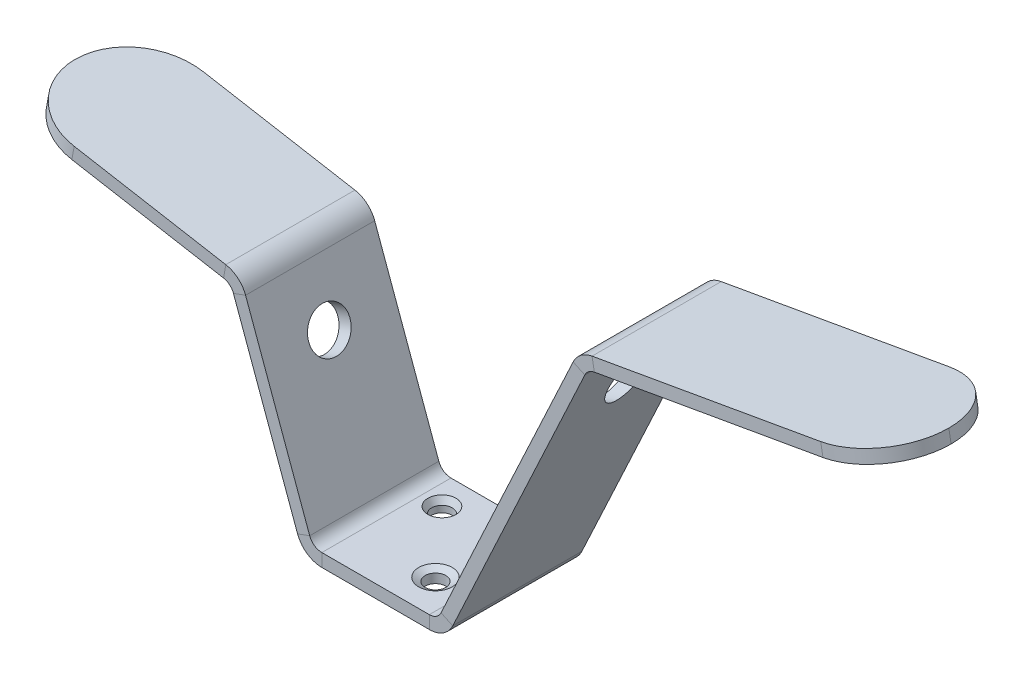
ISO-10303-21;
HEADER;
FILE_DESCRIPTION(('STEP AP214'),'2;1');
FILE_NAME('part.step','',(''),(''),'','','');
FILE_SCHEMA(('AUTOMOTIVE_DESIGN { 1 0 10303 214 1 1 1 1 }'));
ENDSEC;
DATA;
#1=APPLICATION_CONTEXT('core data for automotive mechanical design processes');
#2=APPLICATION_PROTOCOL_DEFINITION('international standard','automotive_design',2000,#1);
#3=PRODUCT_CONTEXT('',#1,'mechanical');
#4=PRODUCT('Part','Part','',(#3));
#5=PRODUCT_RELATED_PRODUCT_CATEGORY('part','',(#4));
#6=PRODUCT_DEFINITION_FORMATION('','',#4);
#7=PRODUCT_DEFINITION_CONTEXT('part definition',#1,'design');
#8=PRODUCT_DEFINITION('design','',#6,#7);
#9=PRODUCT_DEFINITION_SHAPE('','',#8);
#10=(LENGTH_UNIT() NAMED_UNIT(*) SI_UNIT(.MILLI.,.METRE.));
#11=(NAMED_UNIT(*) PLANE_ANGLE_UNIT() SI_UNIT($,.RADIAN.));
#12=(NAMED_UNIT(*) SI_UNIT($,.STERADIAN.) SOLID_ANGLE_UNIT());
#13=UNCERTAINTY_MEASURE_WITH_UNIT(LENGTH_MEASURE(1.E-05),#10,'distance_accuracy_value','');
#14=(GEOMETRIC_REPRESENTATION_CONTEXT(3) GLOBAL_UNCERTAINTY_ASSIGNED_CONTEXT((#13)) GLOBAL_UNIT_ASSIGNED_CONTEXT((#10,
#11,#12)) REPRESENTATION_CONTEXT('',''));
#15=CARTESIAN_POINT('',(0.,0.,0.));
#16=DIRECTION('',(0.,0.,1.));
#17=DIRECTION('',(1.,0.,0.));
#18=AXIS2_PLACEMENT_3D('',#15,#16,#17);
#19=CARTESIAN_POINT('',(-71.2127899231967,-40.1106257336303,-10.));
#20=DIRECTION('',(0.173648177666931,0.984807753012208,0.));
#21=DIRECTION('',(-0.984807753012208,0.173648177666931,0.));
#22=AXIS2_PLACEMENT_3D('',#19,#20,#21);
#23=CYLINDRICAL_SURFACE('',#22,10.);
#24=DIRECTION('',(0.173648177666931,0.984807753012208,0.));
#25=VECTOR('',#24,1.);
#26=CARTESIAN_POINT('',(-81.0608674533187,-38.374143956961,-10.));
#27=LINE('',#26,#25);
#28=CARTESIAN_POINT('',(-67.7549360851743,37.0875427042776,-10.));
#29=VERTEX_POINT('',#28);
#30=CARTESIAN_POINT('',(-67.4076397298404,39.057158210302,-10.));
#31=VERTEX_POINT('',#30);
#32=EDGE_CURVE('E254',#29,#31,#27,.T.);
#33=ORIENTED_EDGE('',*,*,#32,.F.);
#34=CARTESIAN_POINT('',(-57.9068585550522,35.3510609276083,-10.));
#35=DIRECTION('',(0.173648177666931,0.984807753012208,0.));
#36=DIRECTION('',(0.984807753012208,-0.173648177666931,0.));
#37=AXIS2_PLACEMENT_3D('',#34,#35,#36);
#38=CIRCLE('',#37,10.);
#39=CARTESIAN_POINT('',(-57.9068585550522,35.3510609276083,0.));
#40=VERTEX_POINT('',#39);
#41=EDGE_CURVE('E284',#29,#40,#38,.T.);
#42=ORIENTED_EDGE('',*,*,#41,.T.);
#43=DIRECTION('',(0.173648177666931,0.984807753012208,0.));
#44=VECTOR('',#43,1.);
#45=CARTESIAN_POINT('',(-71.2127899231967,-40.1106257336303,0.));
#46=LINE('',#45,#44);
#47=CARTESIAN_POINT('',(-57.5595621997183,37.3206764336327,0.));
#48=VERTEX_POINT('',#47);
#49=EDGE_CURVE('E258',#40,#48,#46,.T.);
#50=ORIENTED_EDGE('',*,*,#49,.T.);
#51=CARTESIAN_POINT('',(-57.5595621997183,37.3206764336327,-10.));
#52=DIRECTION('',(0.173648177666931,0.984807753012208,0.));
#53=DIRECTION('',(0.984807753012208,-0.173648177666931,0.));
#54=AXIS2_PLACEMENT_3D('',#51,#52,#53);
#55=CIRCLE('',#54,10.);
#56=EDGE_CURVE('E262',#48,#31,#55,.F.);
#57=ORIENTED_EDGE('',*,*,#56,.T.);
#58=EDGE_LOOP('',(#33,#42,#50,#57));
#59=FACE_BOUND('',#58,.T.);
#60=ADVANCED_FACE('F26',(#59),#23,.T.);
#61=CARTESIAN_POINT('',(-71.2127899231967,-40.1106257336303,-10.));
#62=DIRECTION('',(0.173648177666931,0.984807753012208,0.));
#63=DIRECTION('',(-0.984807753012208,0.173648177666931,0.));
#64=AXIS2_PLACEMENT_3D('',#61,#62,#63);
#65=CYLINDRICAL_SURFACE('',#64,10.);
#66=DIRECTION('',(0.173648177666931,0.984807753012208,0.));
#67=VECTOR('',#66,1.);
#68=CARTESIAN_POINT('',(-71.2127899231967,-40.1106257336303,-20.));
#69=LINE('',#68,#67);
#70=CARTESIAN_POINT('',(-57.9068585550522,35.3510609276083,-20.));
#71=VERTEX_POINT('',#70);
#72=CARTESIAN_POINT('',(-57.5595621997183,37.3206764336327,-20.));
#73=VERTEX_POINT('',#72);
#74=EDGE_CURVE('E275',#71,#73,#69,.T.);
#75=ORIENTED_EDGE('',*,*,#74,.F.);
#76=CARTESIAN_POINT('',(-57.9068585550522,35.3510609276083,-10.));
#77=DIRECTION('',(0.173648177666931,0.984807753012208,0.));
#78=DIRECTION('',(0.984807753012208,-0.173648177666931,0.));
#79=AXIS2_PLACEMENT_3D('',#76,#77,#78);
#80=CIRCLE('',#79,10.);
#81=EDGE_CURVE('E443',#71,#29,#80,.T.);
#82=ORIENTED_EDGE('',*,*,#81,.T.);
#83=ORIENTED_EDGE('',*,*,#32,.T.);
#84=CARTESIAN_POINT('',(-57.5595621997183,37.3206764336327,-10.));
#85=DIRECTION('',(0.173648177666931,0.984807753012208,0.));
#86=DIRECTION('',(0.984807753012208,-0.173648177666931,0.));
#87=AXIS2_PLACEMENT_3D('',#84,#85,#86);
#88=CIRCLE('',#87,10.);
#89=EDGE_CURVE('E69',#31,#73,#88,.F.);
#90=ORIENTED_EDGE('',*,*,#89,.T.);
#91=EDGE_LOOP('',(#75,#82,#83,#90));
#92=FACE_BOUND('',#91,.T.);
#93=ADVANCED_FACE('F449',(#92),#65,.T.);
#94=CARTESIAN_POINT('',(-46.5925960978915,-44.4518301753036,-20.));
#95=DIRECTION('',(0.,0.,1.));
#96=DIRECTION('',(-0.984807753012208,0.173648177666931,0.));
#97=AXIS2_PLACEMENT_3D('',#94,#95,#96);
#98=PLANE('',#97);
#99=DIRECTION('',(0.173648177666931,0.984807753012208,0.));
#100=VECTOR('',#99,1.);
#101=CARTESIAN_POINT('',(-47.7297541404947,-44.251318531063,-20.));
#102=LINE('',#101,#100);
#103=CARTESIAN_POINT('',(-34.4238227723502,31.2103681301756,-20.));
#104=VERTEX_POINT('',#103);
#105=CARTESIAN_POINT('',(-34.0765264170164,33.1799836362,-20.));
#106=VERTEX_POINT('',#105);
#107=EDGE_CURVE('E272',#104,#106,#102,.T.);
#108=ORIENTED_EDGE('',*,*,#107,.F.);
#109=DIRECTION('',(-0.984807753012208,0.173648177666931,0.));
#110=VECTOR('',#109,1.);
#111=CARTESIAN_POINT('',(-33.286664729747,31.009856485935,-20.));
#112=LINE('',#111,#110);
#113=EDGE_CURVE('E244',#104,#71,#112,.T.);
#114=ORIENTED_EDGE('',*,*,#113,.T.);
#115=ORIENTED_EDGE('',*,*,#74,.T.);
#116=DIRECTION('',(-0.984807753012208,0.173648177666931,0.));
#117=VECTOR('',#116,1.);
#118=CARTESIAN_POINT('',(-32.9393683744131,32.9794719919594,-20.));
#119=LINE('',#118,#117);
#120=EDGE_CURVE('E65',#106,#73,#119,.T.);
#121=ORIENTED_EDGE('',*,*,#120,.F.);
#122=EDGE_LOOP('',(#108,#114,#115,#121));
#123=FACE_BOUND('',#122,.T.);
#124=ADVANCED_FACE('F445',(#123),#98,.F.);
#125=CARTESIAN_POINT('',(-32.9393683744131,32.9794719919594,-20.));
#126=DIRECTION('',(-0.173648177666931,-0.984807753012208,0.));
#127=DIRECTION('',(0.984807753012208,-0.173648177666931,0.));
#128=AXIS2_PLACEMENT_3D('',#125,#126,#127);
#129=PLANE('',#128);
#130=ORIENTED_EDGE('',*,*,#120,.T.);
#131=ORIENTED_EDGE('',*,*,#89,.F.);
#132=ORIENTED_EDGE('',*,*,#56,.F.);
#133=DIRECTION('',(-0.984807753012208,0.173648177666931,0.));
#134=VECTOR('',#133,1.);
#135=CARTESIAN_POINT('',(-32.9393683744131,32.9794719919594,0.));
#136=LINE('',#135,#134);
#137=CARTESIAN_POINT('',(-34.0765264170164,33.1799836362,0.));
#138=VERTEX_POINT('',#137);
#139=EDGE_CURVE('E267',#138,#48,#136,.T.);
#140=ORIENTED_EDGE('',*,*,#139,.F.);
#141=DIRECTION('',(0.,0.,1.));
#142=VECTOR('',#141,1.);
#143=CARTESIAN_POINT('',(-34.0765264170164,33.1799836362,-20.));
#144=LINE('',#143,#142);
#145=EDGE_CURVE('E269',#106,#138,#144,.T.);
#146=ORIENTED_EDGE('',*,*,#145,.F.);
#147=EDGE_LOOP('',(#130,#131,#132,#140,#146));
#148=FACE_BOUND('',#147,.T.);
#149=ADVANCED_FACE('F452',(#148),#129,.F.);
#150=CARTESIAN_POINT('',(-46.5925960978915,-44.4518301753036,0.));
#151=DIRECTION('',(0.,0.,1.));
#152=DIRECTION('',(-0.984807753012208,0.173648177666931,0.));
#153=AXIS2_PLACEMENT_3D('',#150,#151,#152);
#154=PLANE('',#153);
#155=ORIENTED_EDGE('',*,*,#139,.T.);
#156=ORIENTED_EDGE('',*,*,#49,.F.);
#157=DIRECTION('',(-0.984807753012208,0.173648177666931,0.));
#158=VECTOR('',#157,1.);
#159=CARTESIAN_POINT('',(-33.286664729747,31.009856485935,0.));
#160=LINE('',#159,#158);
#161=CARTESIAN_POINT('',(-34.4238227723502,31.2103681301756,0.));
#162=VERTEX_POINT('',#161);
#163=EDGE_CURVE('E43',#162,#40,#160,.T.);
#164=ORIENTED_EDGE('',*,*,#163,.F.);
#165=DIRECTION('',(0.173648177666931,0.984807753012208,0.));
#166=VECTOR('',#165,1.);
#167=CARTESIAN_POINT('',(-47.7297541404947,-44.251318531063,0.));
#168=LINE('',#167,#166);
#169=EDGE_CURVE('E246',#162,#138,#168,.T.);
#170=ORIENTED_EDGE('',*,*,#169,.T.);
#171=EDGE_LOOP('',(#155,#156,#164,#170));
#172=FACE_BOUND('',#171,.T.);
#173=ADVANCED_FACE('F256',(#172),#154,.T.);
#174=CARTESIAN_POINT('',(-33.286664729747,31.009856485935,-20.));
#175=DIRECTION('',(-0.173648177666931,-0.984807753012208,0.));
#176=DIRECTION('',(0.984807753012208,-0.173648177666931,0.));
#177=AXIS2_PLACEMENT_3D('',#174,#175,#176);
#178=PLANE('',#177);
#179=DIRECTION('',(0.,0.,1.));
#180=VECTOR('',#179,1.);
#181=CARTESIAN_POINT('',(-34.4238227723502,31.2103681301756,-20.));
#182=LINE('',#181,#180);
#183=EDGE_CURVE('E234',#104,#162,#182,.T.);
#184=ORIENTED_EDGE('',*,*,#183,.T.);
#185=ORIENTED_EDGE('',*,*,#163,.T.);
#186=ORIENTED_EDGE('',*,*,#41,.F.);
#187=ORIENTED_EDGE('',*,*,#81,.F.);
#188=ORIENTED_EDGE('',*,*,#113,.F.);
#189=EDGE_LOOP('',(#184,#185,#186,#187,#188));
#190=FACE_BOUND('',#189,.T.);
#191=ADVANCED_FACE('F28',(#190),#178,.T.);
#192=CARTESIAN_POINT('',(-84.4215460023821,1.92113291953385,-10.));
#193=DIRECTION('',(0.93969262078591,0.342020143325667,0.));
#194=DIRECTION('',(-0.342020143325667,0.93969262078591,0.));
#195=AXIS2_PLACEMENT_3D('',#192,#193,#194);
#196=CYLINDRICAL_SURFACE('',#195,3.2);
#197=CARTESIAN_POINT('',(-29.9193739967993,21.7583012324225,-10.));
#198=DIRECTION('',(0.93969262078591,0.342020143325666,0.));
#199=DIRECTION('',(0.342020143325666,-0.93969262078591,0.));
#200=AXIS2_PLACEMENT_3D('',#197,#198,#199);
#201=CIRCLE('',#200,3.2);
#202=CARTESIAN_POINT('',(-28.8249095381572,18.7512848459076,-10.));
#203=VERTEX_POINT('',#202);
#204=EDGE_CURVE('E434',#203,#203,#201,.T.);
#205=ORIENTED_EDGE('',*,*,#204,.F.);
#206=EDGE_LOOP('',(#205));
#207=FACE_BOUND('',#206,.T.);
#208=CARTESIAN_POINT('',(-28.0399887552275,22.4423415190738,-10.));
#209=DIRECTION('',(0.93969262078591,0.342020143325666,0.));
#210=DIRECTION('',(0.342020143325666,-0.93969262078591,0.));
#211=AXIS2_PLACEMENT_3D('',#208,#209,#210);
#212=CIRCLE('',#211,3.2);
#213=CARTESIAN_POINT('',(-26.9455242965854,19.4353251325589,-10.));
#214=VERTEX_POINT('',#213);
#215=EDGE_CURVE('E412',#214,#214,#212,.T.);
#216=ORIENTED_EDGE('',*,*,#215,.T.);
#217=EDGE_LOOP('',(#216));
#218=FACE_BOUND('',#217,.T.);
#219=ADVANCED_FACE('F537',(#207,#218),#196,.F.);
#220=CARTESIAN_POINT('',(46.1548658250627,24.8063424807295,0.));
#221=DIRECTION('',(0.,0.,-1.));
#222=DIRECTION('',(0.342020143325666,-0.93969262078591,0.));
#223=AXIS2_PLACEMENT_3D('',#220,#221,#222);
#224=PLANE('',#223);
#225=DIRECTION('',(0.342020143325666,-0.93969262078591,0.));
#226=VECTOR('',#225,1.);
#227=CARTESIAN_POINT('',(-22.,0.,0.));
#228=LINE('',#227,#226);
#229=CARTESIAN_POINT('',(-32.8917338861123,29.9247929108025,0.));
#230=VERTEX_POINT('',#229);
#231=CARTESIAN_POINT('',(-22.9579403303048,2.63191942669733,0.));
#232=VERTEX_POINT('',#231);
#233=EDGE_CURVE('E423',#230,#232,#228,.T.);
#234=ORIENTED_EDGE('',*,*,#233,.T.);
#235=DIRECTION('',(-0.93969262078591,-0.342020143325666,0.));
#236=VECTOR('',#235,1.);
#237=CARTESIAN_POINT('',(45.1969254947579,27.4382619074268,0.));
#238=LINE('',#237,#236);
#239=CARTESIAN_POINT('',(-21.078555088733,3.31595971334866,0.));
#240=VERTEX_POINT('',#239);
#241=EDGE_CURVE('E426',#240,#232,#238,.T.);
#242=ORIENTED_EDGE('',*,*,#241,.F.);
#243=DIRECTION('',(0.342020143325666,-0.93969262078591,0.));
#244=VECTOR('',#243,1.);
#245=CARTESIAN_POINT('',(-20.1206147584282,0.684040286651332,0.));
#246=LINE('',#245,#244);
#247=CARTESIAN_POINT('',(-31.0123486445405,30.6088331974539,0.));
#248=VERTEX_POINT('',#247);
#249=EDGE_CURVE('E428',#248,#240,#246,.T.);
#250=ORIENTED_EDGE('',*,*,#249,.F.);
#251=DIRECTION('',(-0.93969262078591,-0.342020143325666,0.));
#252=VECTOR('',#251,1.);
#253=CARTESIAN_POINT('',(35.2631319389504,54.731135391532,0.));
#254=LINE('',#253,#252);
#255=EDGE_CURVE('E431',#248,#230,#254,.T.);
#256=ORIENTED_EDGE('',*,*,#255,.T.);
#257=EDGE_LOOP('',(#234,#242,#250,#256));
#258=FACE_BOUND('',#257,.T.);
#259=ADVANCED_FACE('F505',(#258),#224,.F.);
#260=CARTESIAN_POINT('',(-22.,0.,-20.));
#261=DIRECTION('',(-0.93969262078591,-0.342020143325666,0.));
#262=DIRECTION('',(0.342020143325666,-0.93969262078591,0.));
#263=AXIS2_PLACEMENT_3D('',#260,#261,#262);
#264=PLANE('',#263);
#265=DIRECTION('',(0.,0.,-1.));
#266=VECTOR('',#265,1.);
#267=CARTESIAN_POINT('',(-32.8917338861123,29.9247929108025,-20.));
#268=LINE('',#267,#266);
#269=CARTESIAN_POINT('',(-32.8917338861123,29.9247929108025,-20.));
#270=VERTEX_POINT('',#269);
#271=EDGE_CURVE('E237',#230,#270,#268,.T.);
#272=ORIENTED_EDGE('',*,*,#271,.T.);
#273=DIRECTION('',(-0.342020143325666,0.93969262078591,0.));
#274=VECTOR('',#273,1.);
#275=CARTESIAN_POINT('',(-22.,0.,-20.));
#276=LINE('',#275,#274);
#277=CARTESIAN_POINT('',(-22.9579403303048,2.63191942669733,-20.));
#278=VERTEX_POINT('',#277);
#279=EDGE_CURVE('E420',#278,#270,#276,.T.);
#280=ORIENTED_EDGE('',*,*,#279,.F.);
#281=DIRECTION('',(0.,0.,1.));
#282=VECTOR('',#281,1.);
#283=CARTESIAN_POINT('',(-22.9579403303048,2.63191942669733,0.));
#284=LINE('',#283,#282);
#285=EDGE_CURVE('E437',#278,#232,#284,.T.);
#286=ORIENTED_EDGE('',*,*,#285,.T.);
#287=ORIENTED_EDGE('',*,*,#233,.F.);
#288=EDGE_LOOP('',(#272,#280,#286,#287));
#289=FACE_BOUND('',#288,.T.);
#290=ORIENTED_EDGE('',*,*,#204,.T.);
#291=EDGE_LOOP('',(#290));
#292=FACE_BOUND('',#291,.T.);
#293=ADVANCED_FACE('F499',(#289,#292),#264,.T.);
#294=CARTESIAN_POINT('',(46.1548658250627,24.8063424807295,-20.));
#295=DIRECTION('',(0.,0.,-1.));
#296=DIRECTION('',(0.342020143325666,-0.93969262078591,0.));
#297=AXIS2_PLACEMENT_3D('',#294,#295,#296);
#298=PLANE('',#297);
#299=DIRECTION('',(-0.93969262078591,-0.342020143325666,0.));
#300=VECTOR('',#299,1.);
#301=CARTESIAN_POINT('',(35.2631319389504,54.731135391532,-20.));
#302=LINE('',#301,#300);
#303=CARTESIAN_POINT('',(-31.0123486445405,30.6088331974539,-20.));
#304=VERTEX_POINT('',#303);
#305=EDGE_CURVE('E418',#304,#270,#302,.T.);
#306=ORIENTED_EDGE('',*,*,#305,.F.);
#307=DIRECTION('',(-0.342020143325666,0.93969262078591,0.));
#308=VECTOR('',#307,1.);
#309=CARTESIAN_POINT('',(-20.1206147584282,0.684040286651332,-20.));
#310=LINE('',#309,#308);
#311=CARTESIAN_POINT('',(-21.078555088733,3.31595971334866,-20.));
#312=VERTEX_POINT('',#311);
#313=EDGE_CURVE('E415',#312,#304,#310,.T.);
#314=ORIENTED_EDGE('',*,*,#313,.F.);
#315=DIRECTION('',(-0.93969262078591,-0.342020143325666,0.));
#316=VECTOR('',#315,1.);
#317=CARTESIAN_POINT('',(45.1969254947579,27.4382619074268,-20.));
#318=LINE('',#317,#316);
#319=EDGE_CURVE('E373',#312,#278,#318,.T.);
#320=ORIENTED_EDGE('',*,*,#319,.T.);
#321=ORIENTED_EDGE('',*,*,#279,.T.);
#322=EDGE_LOOP('',(#306,#314,#320,#321));
#323=FACE_BOUND('',#322,.T.);
#324=ADVANCED_FACE('F554',(#323),#298,.T.);
#325=CARTESIAN_POINT('',(-20.1206147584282,0.684040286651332,-20.));
#326=DIRECTION('',(-0.93969262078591,-0.342020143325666,0.));
#327=DIRECTION('',(0.342020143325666,-0.93969262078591,0.));
#328=AXIS2_PLACEMENT_3D('',#325,#326,#327);
#329=PLANE('',#328);
#330=ORIENTED_EDGE('',*,*,#215,.F.);
#331=EDGE_LOOP('',(#330));
#332=FACE_BOUND('',#331,.T.);
#333=ORIENTED_EDGE('',*,*,#249,.T.);
#334=DIRECTION('',(0.,0.,1.));
#335=VECTOR('',#334,1.);
#336=CARTESIAN_POINT('',(-21.078555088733,3.31595971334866,0.));
#337=LINE('',#336,#335);
#338=EDGE_CURVE('E247',#312,#240,#337,.T.);
#339=ORIENTED_EDGE('',*,*,#338,.F.);
#340=ORIENTED_EDGE('',*,*,#313,.T.);
#341=DIRECTION('',(0.,0.,-1.));
#342=VECTOR('',#341,1.);
#343=CARTESIAN_POINT('',(-31.0123486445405,30.6088331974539,-20.));
#344=LINE('',#343,#342);
#345=EDGE_CURVE('E409',#248,#304,#344,.T.);
#346=ORIENTED_EDGE('',*,*,#345,.F.);
#347=EDGE_LOOP('',(#333,#339,#340,#346));
#348=FACE_BOUND('',#347,.T.);
#349=ADVANCED_FACE('F508',(#332,#348),#329,.F.);
#350=CARTESIAN_POINT('',(75.4739365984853,-43.1985139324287,-10.));
#351=DIRECTION('',(-0.173648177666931,0.984807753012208,0.));
#352=DIRECTION('',(-0.984807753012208,-0.173648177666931,0.));
#353=AXIS2_PLACEMENT_3D('',#350,#351,#352);
#354=CYLINDRICAL_SURFACE('',#353,10.);
#355=DIRECTION('',(-0.173648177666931,0.984807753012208,0.));
#356=VECTOR('',#355,1.);
#357=CARTESIAN_POINT('',(85.3220141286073,-41.4620321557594,-10.));
#358=LINE('',#357,#356);
#359=CARTESIAN_POINT('',(68.2621140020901,55.2894692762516,-10.));
#360=VERTEX_POINT('',#359);
#361=CARTESIAN_POINT('',(67.9148176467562,57.259084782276,-10.));
#362=VERTEX_POINT('',#361);
#363=EDGE_CURVE('E402',#360,#362,#358,.T.);
#364=ORIENTED_EDGE('',*,*,#363,.F.);
#365=CARTESIAN_POINT('',(58.414036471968,53.5529874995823,-10.));
#366=DIRECTION('',(-0.173648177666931,0.984807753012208,0.));
#367=DIRECTION('',(0.984807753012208,0.173648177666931,0.));
#368=AXIS2_PLACEMENT_3D('',#365,#366,#367);
#369=CIRCLE('',#368,10.);
#370=CARTESIAN_POINT('',(58.414036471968,53.5529874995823,-20.));
#371=VERTEX_POINT('',#370);
#372=EDGE_CURVE('E374',#360,#371,#369,.T.);
#373=ORIENTED_EDGE('',*,*,#372,.T.);
#374=DIRECTION('',(-0.173648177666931,0.984807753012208,0.));
#375=VECTOR('',#374,1.);
#376=CARTESIAN_POINT('',(75.4739365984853,-43.1985139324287,-20.));
#377=LINE('',#376,#375);
#378=CARTESIAN_POINT('',(58.0667401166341,55.5226030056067,-20.));
#379=VERTEX_POINT('',#378);
#380=EDGE_CURVE('E381',#371,#379,#377,.T.);
#381=ORIENTED_EDGE('',*,*,#380,.T.);
#382=CARTESIAN_POINT('',(58.0667401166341,55.5226030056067,-10.));
#383=DIRECTION('',(-0.173648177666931,0.984807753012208,0.));
#384=DIRECTION('',(0.984807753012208,0.173648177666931,0.));
#385=AXIS2_PLACEMENT_3D('',#382,#383,#384);
#386=CIRCLE('',#385,10.);
#387=EDGE_CURVE('E387',#379,#362,#386,.F.);
#388=ORIENTED_EDGE('',*,*,#387,.T.);
#389=EDGE_LOOP('',(#364,#373,#381,#388));
#390=FACE_BOUND('',#389,.T.);
#391=ADVANCED_FACE('F560',(#390),#354,.T.);
#392=CARTESIAN_POINT('',(75.4739365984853,-43.1985139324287,-10.));
#393=DIRECTION('',(-0.173648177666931,0.984807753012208,0.));
#394=DIRECTION('',(-0.984807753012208,-0.173648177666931,0.));
#395=AXIS2_PLACEMENT_3D('',#392,#393,#394);
#396=CYLINDRICAL_SURFACE('',#395,10.);
#397=DIRECTION('',(-0.173648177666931,0.984807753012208,0.));
#398=VECTOR('',#397,1.);
#399=CARTESIAN_POINT('',(75.4739365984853,-43.1985139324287,0.));
#400=LINE('',#399,#398);
#401=CARTESIAN_POINT('',(58.414036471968,53.5529874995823,0.));
#402=VERTEX_POINT('',#401);
#403=CARTESIAN_POINT('',(58.0667401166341,55.5226030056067,0.));
#404=VERTEX_POINT('',#403);
#405=EDGE_CURVE('E400',#402,#404,#400,.T.);
#406=ORIENTED_EDGE('',*,*,#405,.F.);
#407=CARTESIAN_POINT('',(58.414036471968,53.5529874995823,-10.));
#408=DIRECTION('',(-0.173648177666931,0.984807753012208,0.));
#409=DIRECTION('',(0.984807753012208,0.173648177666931,0.));
#410=AXIS2_PLACEMENT_3D('',#407,#408,#409);
#411=CIRCLE('',#410,10.);
#412=EDGE_CURVE('E136',#402,#360,#411,.T.);
#413=ORIENTED_EDGE('',*,*,#412,.T.);
#414=ORIENTED_EDGE('',*,*,#363,.T.);
#415=CARTESIAN_POINT('',(58.0667401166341,55.5226030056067,-10.));
#416=DIRECTION('',(-0.173648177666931,0.984807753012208,0.));
#417=DIRECTION('',(0.984807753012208,0.173648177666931,0.));
#418=AXIS2_PLACEMENT_3D('',#415,#416,#417);
#419=CIRCLE('',#418,10.);
#420=EDGE_CURVE('E384',#362,#404,#419,.F.);
#421=ORIENTED_EDGE('',*,*,#420,.T.);
#422=EDGE_LOOP('',(#406,#413,#414,#421));
#423=FACE_BOUND('',#422,.T.);
#424=ADVANCED_FACE('F621',(#423),#396,.T.);
#425=CARTESIAN_POINT('',(85.3220141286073,-41.4620321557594,0.));
#426=DIRECTION('',(0.,0.,1.));
#427=DIRECTION('',(-0.984807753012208,-0.173648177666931,0.));
#428=AXIS2_PLACEMENT_3D('',#425,#426,#427);
#429=PLANE('',#428);
#430=DIRECTION('',(-0.984807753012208,-0.173648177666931,0.));
#431=VECTOR('',#430,1.);
#432=CARTESIAN_POINT('',(67.9148176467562,57.259084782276,0.));
#433=LINE('',#432,#431);
#434=CARTESIAN_POINT('',(22.6541701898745,49.2784114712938,0.));
#435=VERTEX_POINT('',#434);
#436=EDGE_CURVE('E393',#404,#435,#433,.T.);
#437=ORIENTED_EDGE('',*,*,#436,.T.);
#438=DIRECTION('',(-0.173648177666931,0.984807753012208,0.));
#439=VECTOR('',#438,1.);
#440=CARTESIAN_POINT('',(40.0613666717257,-49.4427054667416,0.));
#441=LINE('',#440,#439);
#442=CARTESIAN_POINT('',(23.0014665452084,47.3087959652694,0.));
#443=VERTEX_POINT('',#442);
#444=EDGE_CURVE('E396',#443,#435,#441,.T.);
#445=ORIENTED_EDGE('',*,*,#444,.F.);
#446=DIRECTION('',(-0.984807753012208,-0.173648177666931,0.));
#447=VECTOR('',#446,1.);
#448=CARTESIAN_POINT('',(68.26211400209,55.2894692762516,0.));
#449=LINE('',#448,#447);
#450=EDGE_CURVE('E129',#402,#443,#449,.T.);
#451=ORIENTED_EDGE('',*,*,#450,.F.);
#452=ORIENTED_EDGE('',*,*,#405,.T.);
#453=EDGE_LOOP('',(#437,#445,#451,#452));
#454=FACE_BOUND('',#453,.T.);
#455=ADVANCED_FACE('F625',(#454),#429,.T.);
#456=CARTESIAN_POINT('',(67.9148176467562,57.259084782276,-20.));
#457=DIRECTION('',(0.173648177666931,-0.984807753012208,0.));
#458=DIRECTION('',(0.984807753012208,0.173648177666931,0.));
#459=AXIS2_PLACEMENT_3D('',#456,#457,#458);
#460=PLANE('',#459);
#461=ORIENTED_EDGE('',*,*,#436,.F.);
#462=ORIENTED_EDGE('',*,*,#420,.F.);
#463=ORIENTED_EDGE('',*,*,#387,.F.);
#464=DIRECTION('',(-0.984807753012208,-0.173648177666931,0.));
#465=VECTOR('',#464,1.);
#466=CARTESIAN_POINT('',(67.9148176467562,57.259084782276,-20.));
#467=LINE('',#466,#465);
#468=CARTESIAN_POINT('',(22.6541701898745,49.2784114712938,-20.));
#469=VERTEX_POINT('',#468);
#470=EDGE_CURVE('E378',#379,#469,#467,.T.);
#471=ORIENTED_EDGE('',*,*,#470,.T.);
#472=DIRECTION('',(0.,0.,-1.));
#473=VECTOR('',#472,1.);
#474=CARTESIAN_POINT('',(22.6541701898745,49.2784114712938,0.));
#475=LINE('',#474,#473);
#476=EDGE_CURVE('E390',#435,#469,#475,.T.);
#477=ORIENTED_EDGE('',*,*,#476,.F.);
#478=EDGE_LOOP('',(#461,#462,#463,#471,#477));
#479=FACE_BOUND('',#478,.T.);
#480=ADVANCED_FACE('F628',(#479),#460,.F.);
#481=CARTESIAN_POINT('',(85.3220141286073,-41.4620321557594,-20.));
#482=DIRECTION('',(0.,0.,1.));
#483=DIRECTION('',(-0.984807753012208,-0.173648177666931,0.));
#484=AXIS2_PLACEMENT_3D('',#481,#482,#483);
#485=PLANE('',#484);
#486=ORIENTED_EDGE('',*,*,#380,.F.);
#487=DIRECTION('',(-0.984807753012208,-0.173648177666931,0.));
#488=VECTOR('',#487,1.);
#489=CARTESIAN_POINT('',(68.26211400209,55.2894692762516,-20.));
#490=LINE('',#489,#488);
#491=CARTESIAN_POINT('',(23.0014665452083,47.3087959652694,-20.));
#492=VERTEX_POINT('',#491);
#493=EDGE_CURVE('E107',#371,#492,#490,.T.);
#494=ORIENTED_EDGE('',*,*,#493,.T.);
#495=DIRECTION('',(-0.173648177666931,0.984807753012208,0.));
#496=VECTOR('',#495,1.);
#497=CARTESIAN_POINT('',(40.0613666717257,-49.4427054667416,-20.));
#498=LINE('',#497,#496);
#499=EDGE_CURVE('E404',#492,#469,#498,.T.);
#500=ORIENTED_EDGE('',*,*,#499,.T.);
#501=ORIENTED_EDGE('',*,*,#470,.F.);
#502=EDGE_LOOP('',(#486,#494,#500,#501));
#503=FACE_BOUND('',#502,.T.);
#504=ADVANCED_FACE('F630',(#503),#485,.F.);
#505=CARTESIAN_POINT('',(68.26211400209,55.2894692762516,-20.));
#506=DIRECTION('',(0.173648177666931,-0.984807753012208,0.));
#507=DIRECTION('',(0.984807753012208,0.173648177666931,0.));
#508=AXIS2_PLACEMENT_3D('',#505,#506,#507);
#509=PLANE('',#508);
#510=DIRECTION('',(0.,0.,-1.));
#511=VECTOR('',#510,1.);
#512=CARTESIAN_POINT('',(23.0014665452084,47.3087959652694,0.));
#513=LINE('',#512,#511);
#514=EDGE_CURVE('E335',#443,#492,#513,.T.);
#515=ORIENTED_EDGE('',*,*,#514,.T.);
#516=ORIENTED_EDGE('',*,*,#493,.F.);
#517=ORIENTED_EDGE('',*,*,#372,.F.);
#518=ORIENTED_EDGE('',*,*,#412,.F.);
#519=ORIENTED_EDGE('',*,*,#450,.T.);
#520=EDGE_LOOP('',(#515,#516,#517,#518,#519));
#521=FACE_BOUND('',#520,.T.);
#522=ADVANCED_FACE('F550',(#521),#509,.T.);
#523=CARTESIAN_POINT('',(-84.4215460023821,1.92113291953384,-10.));
#524=DIRECTION('',(0.939692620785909,0.342020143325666,0.));
#525=DIRECTION('',(-0.342020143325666,0.93969262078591,0.));
#526=AXIS2_PLACEMENT_3D('',#523,#524,#525);
#527=CYLINDRICAL_SURFACE('',#526,3.2);
#528=CARTESIAN_POINT('',(18.3360798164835,39.3218500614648,-10.));
#529=DIRECTION('',(-0.906307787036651,0.422618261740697,0.));
#530=DIRECTION('',(0.422618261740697,0.906307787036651,0.));
#531=AXIS2_PLACEMENT_3D('',#528,#529,#530);
#532=ELLIPSE('',#531,4.52548339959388,3.2);
#533=CARTESIAN_POINT('',(20.2486317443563,43.4233309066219,-10.));
#534=VERTEX_POINT('',#533);
#535=EDGE_CURVE('E364',#534,#534,#532,.T.);
#536=ORIENTED_EDGE('',*,*,#535,.F.);
#537=EDGE_LOOP('',(#536));
#538=FACE_BOUND('',#537,.T.);
#539=CARTESIAN_POINT('',(15.6782277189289,38.354471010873,-10.));
#540=DIRECTION('',(-0.906307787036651,0.422618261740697,0.));
#541=DIRECTION('',(0.422618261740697,0.906307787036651,0.));
#542=AXIS2_PLACEMENT_3D('',#539,#540,#541);
#543=ELLIPSE('',#542,4.52548339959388,3.2);
#544=CARTESIAN_POINT('',(17.5907796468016,42.45595185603,-10.));
#545=VERTEX_POINT('',#544);
#546=EDGE_CURVE('E345',#545,#545,#543,.T.);
#547=ORIENTED_EDGE('',*,*,#546,.T.);
#548=EDGE_LOOP('',(#547));
#549=FACE_BOUND('',#548,.T.);
#550=ADVANCED_FACE('F604',(#538,#549),#527,.F.);
#551=CARTESIAN_POINT('',(-74.7798911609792,92.2460877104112,-20.));
#552=DIRECTION('',(0.,0.,-1.));
#553=DIRECTION('',(0.422618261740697,0.906307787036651,0.));
#554=AXIS2_PLACEMENT_3D('',#551,#552,#553);
#555=PLANE('',#554);
#556=DIRECTION('',(0.906307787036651,-0.422618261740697,0.));
#557=VECTOR('',#556,1.);
#558=CARTESIAN_POINT('',(-95.6790906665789,47.4276097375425,-20.));
#559=LINE('',#558,#557);
#560=CARTESIAN_POINT('',(-0.735665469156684,3.1547634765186,-20.));
#561=VERTEX_POINT('',#560);
#562=CARTESIAN_POINT('',(1.07695010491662,2.30952695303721,-20.));
#563=VERTEX_POINT('',#562);
#564=EDGE_CURVE('E356',#561,#563,#559,.T.);
#565=ORIENTED_EDGE('',*,*,#564,.F.);
#566=DIRECTION('',(0.422618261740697,0.906307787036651,0.));
#567=VECTOR('',#566,1.);
#568=CARTESIAN_POINT('',(20.163534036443,47.9732414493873,-20.));
#569=LINE('',#568,#567);
#570=CARTESIAN_POINT('',(19.7235317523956,47.0296535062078,-20.));
#571=VERTEX_POINT('',#570);
#572=EDGE_CURVE('E342',#561,#571,#569,.T.);
#573=ORIENTED_EDGE('',*,*,#572,.T.);
#574=DIRECTION('',(0.906307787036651,-0.422618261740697,0.));
#575=VECTOR('',#574,1.);
#576=CARTESIAN_POINT('',(-75.2198934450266,91.3024997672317,-20.));
#577=LINE('',#576,#575);
#578=CARTESIAN_POINT('',(21.5361473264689,46.1844169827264,-20.));
#579=VERTEX_POINT('',#578);
#580=EDGE_CURVE('E358',#571,#579,#577,.T.);
#581=ORIENTED_EDGE('',*,*,#580,.T.);
#582=DIRECTION('',(0.422618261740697,0.906307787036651,0.));
#583=VECTOR('',#582,1.);
#584=CARTESIAN_POINT('',(21.9761496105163,47.1280049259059,-20.));
#585=LINE('',#584,#583);
#586=EDGE_CURVE('E353',#563,#579,#585,.T.);
#587=ORIENTED_EDGE('',*,*,#586,.F.);
#588=EDGE_LOOP('',(#565,#573,#581,#587));
#589=FACE_BOUND('',#588,.T.);
#590=ADVANCED_FACE('F575',(#589),#555,.T.);
#591=CARTESIAN_POINT('',(21.9761496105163,47.1280049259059,-20.));
#592=DIRECTION('',(0.906307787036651,-0.422618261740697,0.));
#593=DIRECTION('',(0.422618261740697,0.906307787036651,0.));
#594=AXIS2_PLACEMENT_3D('',#591,#592,#593);
#595=PLANE('',#594);
#596=DIRECTION('',(0.,0.,1.));
#597=VECTOR('',#596,1.);
#598=CARTESIAN_POINT('',(21.5361473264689,46.1844169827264,0.));
#599=LINE('',#598,#597);
#600=CARTESIAN_POINT('',(21.5361473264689,46.1844169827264,0.));
#601=VERTEX_POINT('',#600);
#602=EDGE_CURVE('E361',#579,#601,#599,.T.);
#603=ORIENTED_EDGE('',*,*,#602,.T.);
#604=DIRECTION('',(-0.422618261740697,-0.906307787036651,0.));
#605=VECTOR('',#604,1.);
#606=CARTESIAN_POINT('',(21.9761496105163,47.1280049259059,0.));
#607=LINE('',#606,#605);
#608=CARTESIAN_POINT('',(1.07695010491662,2.30952695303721,0.));
#609=VERTEX_POINT('',#608);
#610=EDGE_CURVE('E350',#601,#609,#607,.T.);
#611=ORIENTED_EDGE('',*,*,#610,.T.);
#612=DIRECTION('',(0.,0.,-1.));
#613=VECTOR('',#612,1.);
#614=CARTESIAN_POINT('',(1.07695010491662,2.30952695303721,-20.));
#615=LINE('',#614,#613);
#616=EDGE_CURVE('E367',#609,#563,#615,.T.);
#617=ORIENTED_EDGE('',*,*,#616,.T.);
#618=ORIENTED_EDGE('',*,*,#586,.T.);
#619=EDGE_LOOP('',(#603,#611,#617,#618));
#620=FACE_BOUND('',#619,.T.);
#621=ORIENTED_EDGE('',*,*,#535,.T.);
#622=EDGE_LOOP('',(#621));
#623=FACE_BOUND('',#622,.T.);
#624=ADVANCED_FACE('F570',(#620,#623),#595,.T.);
#625=CARTESIAN_POINT('',(-74.7798911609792,92.2460877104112,0.));
#626=DIRECTION('',(0.,0.,-1.));
#627=DIRECTION('',(0.422618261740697,0.906307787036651,0.));
#628=AXIS2_PLACEMENT_3D('',#625,#626,#627);
#629=PLANE('',#628);
#630=ORIENTED_EDGE('',*,*,#610,.F.);
#631=DIRECTION('',(0.906307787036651,-0.422618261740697,0.));
#632=VECTOR('',#631,1.);
#633=CARTESIAN_POINT('',(-75.2198934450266,91.3024997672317,0.));
#634=LINE('',#633,#632);
#635=CARTESIAN_POINT('',(19.7235317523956,47.0296535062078,0.));
#636=VERTEX_POINT('',#635);
#637=EDGE_CURVE('E348',#636,#601,#634,.T.);
#638=ORIENTED_EDGE('',*,*,#637,.F.);
#639=DIRECTION('',(-0.422618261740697,-0.906307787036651,0.));
#640=VECTOR('',#639,1.);
#641=CARTESIAN_POINT('',(20.163534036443,47.9732414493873,0.));
#642=LINE('',#641,#640);
#643=CARTESIAN_POINT('',(-0.735665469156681,3.1547634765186,0.));
#644=VERTEX_POINT('',#643);
#645=EDGE_CURVE('E336',#636,#644,#642,.T.);
#646=ORIENTED_EDGE('',*,*,#645,.T.);
#647=DIRECTION('',(0.906307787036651,-0.422618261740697,0.));
#648=VECTOR('',#647,1.);
#649=CARTESIAN_POINT('',(-95.6790906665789,47.4276097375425,0.));
#650=LINE('',#649,#648);
#651=EDGE_CURVE('E332',#644,#609,#650,.T.);
#652=ORIENTED_EDGE('',*,*,#651,.T.);
#653=EDGE_LOOP('',(#630,#638,#646,#652));
#654=FACE_BOUND('',#653,.T.);
#655=ADVANCED_FACE('F612',(#654),#629,.F.);
#656=CARTESIAN_POINT('',(20.163534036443,47.9732414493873,-20.));
#657=DIRECTION('',(0.906307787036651,-0.422618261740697,0.));
#658=DIRECTION('',(0.422618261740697,0.906307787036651,0.));
#659=AXIS2_PLACEMENT_3D('',#656,#657,#658);
#660=PLANE('',#659);
#661=ORIENTED_EDGE('',*,*,#546,.F.);
#662=EDGE_LOOP('',(#661));
#663=FACE_BOUND('',#662,.T.);
#664=ORIENTED_EDGE('',*,*,#572,.F.);
#665=DIRECTION('',(0.,0.,-1.));
#666=VECTOR('',#665,1.);
#667=CARTESIAN_POINT('',(-0.735665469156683,3.15476347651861,-20.));
#668=LINE('',#667,#666);
#669=EDGE_CURVE('E333',#644,#561,#668,.T.);
#670=ORIENTED_EDGE('',*,*,#669,.F.);
#671=ORIENTED_EDGE('',*,*,#645,.F.);
#672=DIRECTION('',(0.,0.,1.));
#673=VECTOR('',#672,1.);
#674=CARTESIAN_POINT('',(19.7235317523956,47.0296535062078,0.));
#675=LINE('',#674,#673);
#676=EDGE_CURVE('E339',#571,#636,#675,.T.);
#677=ORIENTED_EDGE('',*,*,#676,.F.);
#678=EDGE_LOOP('',(#664,#670,#671,#677));
#679=FACE_BOUND('',#678,.T.);
#680=ADVANCED_FACE('F597',(#663,#679),#660,.F.);
#681=CARTESIAN_POINT('',(0.,0.,-20.));
#682=DIRECTION('',(0.,-1.,0.));
#683=DIRECTION('',(1.,0.,0.));
#684=AXIS2_PLACEMENT_3D('',#681,#682,#683);
#685=PLANE('',#684);
#686=CARTESIAN_POINT('',(-7.09958492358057,0.,-5.5));
#687=DIRECTION('',(0.,-1.,0.));
#688=DIRECTION('',(-1.,0.,0.));
#689=AXIS2_PLACEMENT_3D('',#686,#687,#688);
#690=CIRCLE('',#689,1.6);
#691=CARTESIAN_POINT('',(-8.69958492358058,0.,-5.5));
#692=VERTEX_POINT('',#691);
#693=EDGE_CURVE('E481',#692,#692,#690,.T.);
#694=ORIENTED_EDGE('',*,*,#693,.F.);
#695=EDGE_LOOP('',(#694));
#696=FACE_BOUND('',#695,.T.);
#697=CARTESIAN_POINT('',(-16.0995849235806,0.,-15.5));
#698=DIRECTION('',(0.,-1.,0.));
#699=DIRECTION('',(-1.,0.,0.));
#700=AXIS2_PLACEMENT_3D('',#697,#698,#699);
#701=CIRCLE('',#700,1.6);
#702=CARTESIAN_POINT('',(-17.6995849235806,0.,-15.5));
#703=VERTEX_POINT('',#702);
#704=EDGE_CURVE('E484',#703,#703,#701,.T.);
#705=ORIENTED_EDGE('',*,*,#704,.F.);
#706=EDGE_LOOP('',(#705));
#707=FACE_BOUND('',#706,.T.);
#708=DIRECTION('',(-1.,0.,0.));
#709=VECTOR('',#708,1.);
#710=CARTESIAN_POINT('',(0.,0.,-20.));
#711=LINE('',#710,#709);
#712=CARTESIAN_POINT('',(-2.54828104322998,0.,-20.));
#713=VERTEX_POINT('',#712);
#714=CARTESIAN_POINT('',(-19.1991698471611,0.,-20.));
#715=VERTEX_POINT('',#714);
#716=EDGE_CURVE('E310',#713,#715,#711,.T.);
#717=ORIENTED_EDGE('',*,*,#716,.F.);
#718=DIRECTION('',(0.,0.,-1.));
#719=VECTOR('',#718,1.);
#720=CARTESIAN_POINT('',(-2.54828104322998,0.,-20.));
#721=LINE('',#720,#719);
#722=CARTESIAN_POINT('',(-2.54828104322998,0.,0.));
#723=VERTEX_POINT('',#722);
#724=EDGE_CURVE('E330',#723,#713,#721,.T.);
#725=ORIENTED_EDGE('',*,*,#724,.F.);
#726=DIRECTION('',(-1.,0.,0.));
#727=VECTOR('',#726,1.);
#728=CARTESIAN_POINT('',(0.,0.,0.));
#729=LINE('',#728,#727);
#730=CARTESIAN_POINT('',(-19.1991698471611,0.,0.));
#731=VERTEX_POINT('',#730);
#732=EDGE_CURVE('E315',#723,#731,#729,.T.);
#733=ORIENTED_EDGE('',*,*,#732,.T.);
#734=DIRECTION('',(0.,0.,1.));
#735=VECTOR('',#734,1.);
#736=CARTESIAN_POINT('',(-19.1991698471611,0.,0.));
#737=LINE('',#736,#735);
#738=EDGE_CURVE('E309',#715,#731,#737,.T.);
#739=ORIENTED_EDGE('',*,*,#738,.F.);
#740=EDGE_LOOP('',(#717,#725,#733,#739));
#741=FACE_BOUND('',#740,.T.);
#742=ADVANCED_FACE('F296',(#696,#707,#741),#685,.T.);
#743=CARTESIAN_POINT('',(0.,2.,-20.));
#744=DIRECTION('',(0.,-1.,0.));
#745=DIRECTION('',(1.,0.,0.));
#746=AXIS2_PLACEMENT_3D('',#743,#744,#745);
#747=PLANE('',#746);
#748=CARTESIAN_POINT('',(-16.0995849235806,2.,-15.5));
#749=DIRECTION('',(0.,1.,0.));
#750=DIRECTION('',(1.,0.,0.));
#751=AXIS2_PLACEMENT_3D('',#748,#749,#750);
#752=CIRCLE('',#751,2.17735026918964);
#753=CARTESIAN_POINT('',(-13.9222346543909,2.,-15.5));
#754=VERTEX_POINT('',#753);
#755=EDGE_CURVE('E35',#754,#754,#752,.T.);
#756=ORIENTED_EDGE('',*,*,#755,.F.);
#757=EDGE_LOOP('',(#756));
#758=FACE_BOUND('',#757,.T.);
#759=CARTESIAN_POINT('',(-7.09958492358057,2.,-5.5));
#760=DIRECTION('',(0.,1.,0.));
#761=DIRECTION('',(1.,0.,0.));
#762=AXIS2_PLACEMENT_3D('',#759,#760,#761);
#763=CIRCLE('',#762,2.59999999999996);
#764=CARTESIAN_POINT('',(-4.49958492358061,2.,-5.5));
#765=VERTEX_POINT('',#764);
#766=EDGE_CURVE('E283',#765,#765,#763,.T.);
#767=ORIENTED_EDGE('',*,*,#766,.F.);
#768=EDGE_LOOP('',(#767));
#769=FACE_BOUND('',#768,.T.);
#770=DIRECTION('',(0.,0.,1.));
#771=VECTOR('',#770,1.);
#772=CARTESIAN_POINT('',(-19.1991698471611,2.,0.));
#773=LINE('',#772,#771);
#774=CARTESIAN_POINT('',(-19.1991698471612,2.,-20.));
#775=VERTEX_POINT('',#774);
#776=CARTESIAN_POINT('',(-19.1991698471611,2.,0.));
#777=VERTEX_POINT('',#776);
#778=EDGE_CURVE('E303',#775,#777,#773,.T.);
#779=ORIENTED_EDGE('',*,*,#778,.T.);
#780=DIRECTION('',(-1.,0.,0.));
#781=VECTOR('',#780,1.);
#782=CARTESIAN_POINT('',(0.,2.,0.));
#783=LINE('',#782,#781);
#784=CARTESIAN_POINT('',(-2.54828104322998,2.,0.));
#785=VERTEX_POINT('',#784);
#786=EDGE_CURVE('E306',#785,#777,#783,.T.);
#787=ORIENTED_EDGE('',*,*,#786,.F.);
#788=DIRECTION('',(0.,0.,-1.));
#789=VECTOR('',#788,1.);
#790=CARTESIAN_POINT('',(-2.54828104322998,2.,-20.));
#791=LINE('',#790,#789);
#792=CARTESIAN_POINT('',(-2.54828104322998,2.,-20.));
#793=VERTEX_POINT('',#792);
#794=EDGE_CURVE('E328',#785,#793,#791,.T.);
#795=ORIENTED_EDGE('',*,*,#794,.T.);
#796=DIRECTION('',(-1.,0.,0.));
#797=VECTOR('',#796,1.);
#798=CARTESIAN_POINT('',(0.,2.,-20.));
#799=LINE('',#798,#797);
#800=EDGE_CURVE('E308',#793,#775,#799,.T.);
#801=ORIENTED_EDGE('',*,*,#800,.T.);
#802=EDGE_LOOP('',(#779,#787,#795,#801));
#803=FACE_BOUND('',#802,.T.);
#804=ADVANCED_FACE('F292',(#758,#769,#803),#747,.F.);
#805=CARTESIAN_POINT('',(-16.0995849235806,0.,-15.5));
#806=DIRECTION('',(0.,1.,0.));
#807=DIRECTION('',(-1.,0.,0.));
#808=AXIS2_PLACEMENT_3D('',#805,#806,#807);
#809=CYLINDRICAL_SURFACE('',#808,1.6);
#810=CARTESIAN_POINT('',(-16.0995849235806,0.999999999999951,-15.5));
#811=DIRECTION('',(0.,1.,0.));
#812=DIRECTION('',(0.,0.,1.));
#813=AXIS2_PLACEMENT_3D('',#810,#811,#812);
#814=CIRCLE('',#813,1.6);
#815=CARTESIAN_POINT('',(-16.0995849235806,0.999999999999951,-13.9));
#816=VERTEX_POINT('',#815);
#817=EDGE_CURVE('E280',#816,#816,#814,.F.);
#818=ORIENTED_EDGE('',*,*,#817,.F.);
#819=EDGE_LOOP('',(#818));
#820=FACE_BOUND('',#819,.T.);
#821=ORIENTED_EDGE('',*,*,#704,.T.);
#822=EDGE_LOOP('',(#821));
#823=FACE_BOUND('',#822,.T.);
#824=ADVANCED_FACE('F295',(#820,#823),#809,.F.);
#825=CARTESIAN_POINT('',(-7.09958492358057,0.,-5.5));
#826=DIRECTION('',(0.,1.,0.));
#827=DIRECTION('',(-1.,0.,0.));
#828=AXIS2_PLACEMENT_3D('',#825,#826,#827);
#829=CYLINDRICAL_SURFACE('',#828,1.6);
#830=CARTESIAN_POINT('',(-7.09958492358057,1.4226497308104,-5.5));
#831=DIRECTION('',(0.,1.,0.));
#832=DIRECTION('',(0.,0.,1.));
#833=AXIS2_PLACEMENT_3D('',#830,#831,#832);
#834=CIRCLE('',#833,1.6);
#835=CARTESIAN_POINT('',(-7.09958492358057,1.4226497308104,-3.9));
#836=VERTEX_POINT('',#835);
#837=EDGE_CURVE('E11',#836,#836,#834,.F.);
#838=ORIENTED_EDGE('',*,*,#837,.F.);
#839=EDGE_LOOP('',(#838));
#840=FACE_BOUND('',#839,.T.);
#841=ORIENTED_EDGE('',*,*,#693,.T.);
#842=EDGE_LOOP('',(#841));
#843=FACE_BOUND('',#842,.T.);
#844=ADVANCED_FACE('F591',(#840,#843),#829,.F.);
#845=CARTESIAN_POINT('',(0.,54.0481353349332,0.));
#846=DIRECTION('',(0.,0.,-1.));
#847=DIRECTION('',(1.,0.,0.));
#848=AXIS2_PLACEMENT_3D('',#845,#846,#847);
#849=PLANE('',#848);
#850=ORIENTED_EDGE('',*,*,#732,.F.);
#851=DIRECTION('',(0.,-1.,0.));
#852=VECTOR('',#851,1.);
#853=CARTESIAN_POINT('',(-2.54828104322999,54.0481353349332,0.));
#854=LINE('',#853,#852);
#855=EDGE_CURVE('E312',#785,#723,#854,.T.);
#856=ORIENTED_EDGE('',*,*,#855,.F.);
#857=ORIENTED_EDGE('',*,*,#786,.T.);
#858=DIRECTION('',(0.,-1.,0.));
#859=VECTOR('',#858,1.);
#860=CARTESIAN_POINT('',(-19.1991698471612,54.0481353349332,0.));
#861=LINE('',#860,#859);
#862=EDGE_CURVE('E325',#777,#731,#861,.T.);
#863=ORIENTED_EDGE('',*,*,#862,.T.);
#864=EDGE_LOOP('',(#850,#856,#857,#863));
#865=FACE_BOUND('',#864,.T.);
#866=ADVANCED_FACE('F494',(#865),#849,.F.);
#867=CARTESIAN_POINT('',(0.,54.0481353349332,-20.));
#868=DIRECTION('',(0.,0.,-1.));
#869=DIRECTION('',(1.,0.,0.));
#870=AXIS2_PLACEMENT_3D('',#867,#868,#869);
#871=PLANE('',#870);
#872=DIRECTION('',(0.,-1.,0.));
#873=VECTOR('',#872,1.);
#874=CARTESIAN_POINT('',(-19.1991698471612,54.0481353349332,-20.));
#875=LINE('',#874,#873);
#876=EDGE_CURVE('E323',#775,#715,#875,.T.);
#877=ORIENTED_EDGE('',*,*,#876,.F.);
#878=ORIENTED_EDGE('',*,*,#800,.F.);
#879=DIRECTION('',(0.,-1.,0.));
#880=VECTOR('',#879,1.);
#881=CARTESIAN_POINT('',(-2.54828104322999,54.0481353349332,-20.));
#882=LINE('',#881,#880);
#883=EDGE_CURVE('E320',#793,#713,#882,.T.);
#884=ORIENTED_EDGE('',*,*,#883,.T.);
#885=ORIENTED_EDGE('',*,*,#716,.T.);
#886=EDGE_LOOP('',(#877,#878,#884,#885));
#887=FACE_BOUND('',#886,.T.);
#888=ADVANCED_FACE('F566',(#887),#871,.T.);
#889=CARTESIAN_POINT('',(-2.54828104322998,4.,-20.));
#890=DIRECTION('',(0.,0.,-1.));
#891=DIRECTION('',(1.,0.,0.));
#892=AXIS2_PLACEMENT_3D('',#889,#890,#891);
#893=PLANE('',#892);
#894=ORIENTED_EDGE('',*,*,#564,.T.);
#895=CARTESIAN_POINT('',(-2.54828104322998,4.,-20.));
#896=DIRECTION('',(0.,0.,-1.));
#897=DIRECTION('',(-1.,0.,0.));
#898=AXIS2_PLACEMENT_3D('',#895,#896,#897);
#899=CIRCLE('',#898,4.);
#900=EDGE_CURVE('E476',#563,#713,#899,.T.);
#901=ORIENTED_EDGE('',*,*,#900,.T.);
#902=ORIENTED_EDGE('',*,*,#883,.F.);
#903=CARTESIAN_POINT('',(-2.54828104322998,4.,-20.));
#904=DIRECTION('',(0.,0.,-1.));
#905=DIRECTION('',(-1.,0.,0.));
#906=AXIS2_PLACEMENT_3D('',#903,#904,#905);
#907=CIRCLE('',#906,2.);
#908=EDGE_CURVE('E164',#561,#793,#907,.T.);
#909=ORIENTED_EDGE('',*,*,#908,.F.);
#910=EDGE_LOOP('',(#894,#901,#902,#909));
#911=FACE_BOUND('',#910,.T.);
#912=ADVANCED_FACE('F577',(#911),#893,.T.);
#913=CARTESIAN_POINT('',(-2.54828104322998,4.,0.));
#914=DIRECTION('',(0.,0.,1.));
#915=DIRECTION('',(-1.,0.,0.));
#916=AXIS2_PLACEMENT_3D('',#913,#914,#915);
#917=PLANE('',#916);
#918=CARTESIAN_POINT('',(-2.54828104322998,4.,0.));
#919=DIRECTION('',(0.,0.,-1.));
#920=DIRECTION('',(-1.,0.,0.));
#921=AXIS2_PLACEMENT_3D('',#918,#919,#920);
#922=CIRCLE('',#921,2.);
#923=EDGE_CURVE('E157',#785,#644,#922,.F.);
#924=ORIENTED_EDGE('',*,*,#923,.F.);
#925=ORIENTED_EDGE('',*,*,#855,.T.);
#926=CARTESIAN_POINT('',(-2.54828104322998,4.,0.));
#927=DIRECTION('',(0.,0.,-1.));
#928=DIRECTION('',(-1.,0.,0.));
#929=AXIS2_PLACEMENT_3D('',#926,#927,#928);
#930=CIRCLE('',#929,4.);
#931=EDGE_CURVE('E177',#723,#609,#930,.F.);
#932=ORIENTED_EDGE('',*,*,#931,.T.);
#933=ORIENTED_EDGE('',*,*,#651,.F.);
#934=EDGE_LOOP('',(#924,#925,#932,#933));
#935=FACE_BOUND('',#934,.T.);
#936=ADVANCED_FACE('F579',(#935),#917,.T.);
#937=CARTESIAN_POINT('',(-2.54828104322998,4.,-208.077189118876));
#938=DIRECTION('',(0.,0.,1.));
#939=DIRECTION('',(-1.,0.,0.));
#940=AXIS2_PLACEMENT_3D('',#937,#938,#939);
#941=CYLINDRICAL_SURFACE('',#940,4.);
#942=ORIENTED_EDGE('',*,*,#724,.T.);
#943=ORIENTED_EDGE('',*,*,#900,.F.);
#944=ORIENTED_EDGE('',*,*,#616,.F.);
#945=ORIENTED_EDGE('',*,*,#931,.F.);
#946=EDGE_LOOP('',(#942,#943,#944,#945));
#947=FACE_BOUND('',#946,.T.);
#948=ADVANCED_FACE('F567',(#947),#941,.T.);
#949=CARTESIAN_POINT('',(-2.54828104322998,4.,-208.077189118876));
#950=DIRECTION('',(0.,0.,1.));
#951=DIRECTION('',(-1.,0.,0.));
#952=AXIS2_PLACEMENT_3D('',#949,#950,#951);
#953=CYLINDRICAL_SURFACE('',#952,2.);
#954=ORIENTED_EDGE('',*,*,#794,.F.);
#955=ORIENTED_EDGE('',*,*,#923,.T.);
#956=ORIENTED_EDGE('',*,*,#669,.T.);
#957=ORIENTED_EDGE('',*,*,#908,.T.);
#958=EDGE_LOOP('',(#954,#955,#956,#957));
#959=FACE_BOUND('',#958,.T.);
#960=ADVANCED_FACE('F654',(#959),#953,.F.);
#961=CARTESIAN_POINT('',(23.3487629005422,45.339180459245,-20.));
#962=DIRECTION('',(0.,0.,1.));
#963=DIRECTION('',(-1.,0.,0.));
#964=AXIS2_PLACEMENT_3D('',#961,#962,#963);
#965=PLANE('',#964);
#966=ORIENTED_EDGE('',*,*,#580,.F.);
#967=CARTESIAN_POINT('',(23.3487629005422,45.339180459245,-20.));
#968=DIRECTION('',(0.,0.,1.));
#969=DIRECTION('',(1.,0.,0.));
#970=AXIS2_PLACEMENT_3D('',#967,#968,#969);
#971=CIRCLE('',#970,4.);
#972=EDGE_CURVE('E470',#469,#571,#971,.T.);
#973=ORIENTED_EDGE('',*,*,#972,.F.);
#974=ORIENTED_EDGE('',*,*,#499,.F.);
#975=CARTESIAN_POINT('',(23.3487629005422,45.339180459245,-20.));
#976=DIRECTION('',(0.,0.,1.));
#977=DIRECTION('',(1.,0.,0.));
#978=AXIS2_PLACEMENT_3D('',#975,#976,#977);
#979=CIRCLE('',#978,2.);
#980=EDGE_CURVE('E467',#492,#579,#979,.T.);
#981=ORIENTED_EDGE('',*,*,#980,.T.);
#982=EDGE_LOOP('',(#966,#973,#974,#981));
#983=FACE_BOUND('',#982,.T.);
#984=ADVANCED_FACE('F647',(#983),#965,.F.);
#985=CARTESIAN_POINT('',(23.3487629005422,45.339180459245,0.));
#986=DIRECTION('',(0.,0.,-1.));
#987=DIRECTION('',(1.,0.,0.));
#988=AXIS2_PLACEMENT_3D('',#985,#986,#987);
#989=PLANE('',#988);
#990=CARTESIAN_POINT('',(23.3487629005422,45.339180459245,0.));
#991=DIRECTION('',(0.,0.,1.));
#992=DIRECTION('',(1.,0.,0.));
#993=AXIS2_PLACEMENT_3D('',#990,#991,#992);
#994=CIRCLE('',#993,2.);
#995=EDGE_CURVE('E144',#601,#443,#994,.F.);
#996=ORIENTED_EDGE('',*,*,#995,.T.);
#997=ORIENTED_EDGE('',*,*,#444,.T.);
#998=CARTESIAN_POINT('',(23.3487629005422,45.339180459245,0.));
#999=DIRECTION('',(0.,0.,1.));
#1000=DIRECTION('',(1.,0.,0.));
#1001=AXIS2_PLACEMENT_3D('',#998,#999,#1000);
#1002=CIRCLE('',#1001,4.);
#1003=EDGE_CURVE('E472',#636,#435,#1002,.F.);
#1004=ORIENTED_EDGE('',*,*,#1003,.F.);
#1005=ORIENTED_EDGE('',*,*,#637,.T.);
#1006=EDGE_LOOP('',(#996,#997,#1004,#1005));
#1007=FACE_BOUND('',#1006,.T.);
#1008=ADVANCED_FACE('F642',(#1007),#989,.F.);
#1009=CARTESIAN_POINT('',(23.3487629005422,45.339180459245,160.978837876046));
#1010=DIRECTION('',(0.,0.,-1.));
#1011=DIRECTION('',(1.,0.,0.));
#1012=AXIS2_PLACEMENT_3D('',#1009,#1010,#1011);
#1013=CYLINDRICAL_SURFACE('',#1012,4.);
#1014=ORIENTED_EDGE('',*,*,#476,.T.);
#1015=ORIENTED_EDGE('',*,*,#972,.T.);
#1016=ORIENTED_EDGE('',*,*,#676,.T.);
#1017=ORIENTED_EDGE('',*,*,#1003,.T.);
#1018=EDGE_LOOP('',(#1014,#1015,#1016,#1017));
#1019=FACE_BOUND('',#1018,.T.);
#1020=ADVANCED_FACE('F649',(#1019),#1013,.T.);
#1021=CARTESIAN_POINT('',(23.3487629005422,45.339180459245,160.978837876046));
#1022=DIRECTION('',(0.,0.,-1.));
#1023=DIRECTION('',(1.,0.,0.));
#1024=AXIS2_PLACEMENT_3D('',#1021,#1022,#1023);
#1025=CYLINDRICAL_SURFACE('',#1024,2.);
#1026=ORIENTED_EDGE('',*,*,#514,.F.);
#1027=ORIENTED_EDGE('',*,*,#995,.F.);
#1028=ORIENTED_EDGE('',*,*,#602,.F.);
#1029=ORIENTED_EDGE('',*,*,#980,.F.);
#1030=EDGE_LOOP('',(#1026,#1027,#1028,#1029));
#1031=FACE_BOUND('',#1030,.T.);
#1032=ADVANCED_FACE('F644',(#1031),#1025,.F.);
#1033=CARTESIAN_POINT('',(-19.1991698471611,4.,0.));
#1034=DIRECTION('',(0.,0.,1.));
#1035=DIRECTION('',(-1.,0.,0.));
#1036=AXIS2_PLACEMENT_3D('',#1033,#1034,#1035);
#1037=PLANE('',#1036);
#1038=ORIENTED_EDGE('',*,*,#241,.T.);
#1039=CARTESIAN_POINT('',(-19.1991698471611,4.,0.));
#1040=DIRECTION('',(0.,0.,1.));
#1041=DIRECTION('',(1.,0.,0.));
#1042=AXIS2_PLACEMENT_3D('',#1039,#1040,#1041);
#1043=CIRCLE('',#1042,4.);
#1044=EDGE_CURVE('E464',#232,#731,#1043,.T.);
#1045=ORIENTED_EDGE('',*,*,#1044,.T.);
#1046=ORIENTED_EDGE('',*,*,#862,.F.);
#1047=CARTESIAN_POINT('',(-19.1991698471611,4.,0.));
#1048=DIRECTION('',(0.,0.,1.));
#1049=DIRECTION('',(1.,0.,0.));
#1050=AXIS2_PLACEMENT_3D('',#1047,#1048,#1049);
#1051=CIRCLE('',#1050,2.);
#1052=EDGE_CURVE('E99',#240,#777,#1051,.T.);
#1053=ORIENTED_EDGE('',*,*,#1052,.F.);
#1054=EDGE_LOOP('',(#1038,#1045,#1046,#1053));
#1055=FACE_BOUND('',#1054,.T.);
#1056=ADVANCED_FACE('F502',(#1055),#1037,.T.);
#1057=CARTESIAN_POINT('',(-19.1991698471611,4.,-20.));
#1058=DIRECTION('',(0.,0.,-1.));
#1059=DIRECTION('',(1.,0.,0.));
#1060=AXIS2_PLACEMENT_3D('',#1057,#1058,#1059);
#1061=PLANE('',#1060);
#1062=CARTESIAN_POINT('',(-19.1991698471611,4.,-20.));
#1063=DIRECTION('',(0.,0.,1.));
#1064=DIRECTION('',(1.,0.,0.));
#1065=AXIS2_PLACEMENT_3D('',#1062,#1063,#1064);
#1066=CIRCLE('',#1065,2.);
#1067=EDGE_CURVE('E91',#775,#312,#1066,.F.);
#1068=ORIENTED_EDGE('',*,*,#1067,.F.);
#1069=ORIENTED_EDGE('',*,*,#876,.T.);
#1070=CARTESIAN_POINT('',(-19.1991698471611,4.,-20.));
#1071=DIRECTION('',(0.,0.,1.));
#1072=DIRECTION('',(1.,0.,0.));
#1073=AXIS2_PLACEMENT_3D('',#1070,#1071,#1072);
#1074=CIRCLE('',#1073,4.);
#1075=EDGE_CURVE('E170',#715,#278,#1074,.F.);
#1076=ORIENTED_EDGE('',*,*,#1075,.T.);
#1077=ORIENTED_EDGE('',*,*,#319,.F.);
#1078=EDGE_LOOP('',(#1068,#1069,#1076,#1077));
#1079=FACE_BOUND('',#1078,.T.);
#1080=ADVANCED_FACE('F563',(#1079),#1061,.T.);
#1081=CARTESIAN_POINT('',(-19.1991698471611,4.,168.455300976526));
#1082=DIRECTION('',(0.,0.,-1.));
#1083=DIRECTION('',(1.,0.,0.));
#1084=AXIS2_PLACEMENT_3D('',#1081,#1082,#1083);
#1085=CYLINDRICAL_SURFACE('',#1084,4.);
#1086=ORIENTED_EDGE('',*,*,#738,.T.);
#1087=ORIENTED_EDGE('',*,*,#1044,.F.);
#1088=ORIENTED_EDGE('',*,*,#285,.F.);
#1089=ORIENTED_EDGE('',*,*,#1075,.F.);
#1090=EDGE_LOOP('',(#1086,#1087,#1088,#1089));
#1091=FACE_BOUND('',#1090,.T.);
#1092=ADVANCED_FACE('F495',(#1091),#1085,.T.);
#1093=CARTESIAN_POINT('',(-19.1991698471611,4.,168.455300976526));
#1094=DIRECTION('',(0.,0.,-1.));
#1095=DIRECTION('',(1.,0.,0.));
#1096=AXIS2_PLACEMENT_3D('',#1093,#1094,#1095);
#1097=CYLINDRICAL_SURFACE('',#1096,2.);
#1098=ORIENTED_EDGE('',*,*,#778,.F.);
#1099=ORIENTED_EDGE('',*,*,#1067,.T.);
#1100=ORIENTED_EDGE('',*,*,#338,.T.);
#1101=ORIENTED_EDGE('',*,*,#1052,.T.);
#1102=EDGE_LOOP('',(#1098,#1099,#1100,#1101));
#1103=FACE_BOUND('',#1102,.T.);
#1104=ADVANCED_FACE('F674',(#1103),#1097,.F.);
#1105=CARTESIAN_POINT('',(-34.7711191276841,29.2407526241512,0.));
#1106=DIRECTION('',(0.,0.,-1.));
#1107=DIRECTION('',(1.,0.,0.));
#1108=AXIS2_PLACEMENT_3D('',#1105,#1106,#1107);
#1109=PLANE('',#1108);
#1110=ORIENTED_EDGE('',*,*,#255,.F.);
#1111=CARTESIAN_POINT('',(-34.7711191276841,29.2407526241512,0.));
#1112=DIRECTION('',(0.,0.,-1.));
#1113=DIRECTION('',(-1.,0.,0.));
#1114=AXIS2_PLACEMENT_3D('',#1111,#1112,#1113);
#1115=CIRCLE('',#1114,4.);
#1116=EDGE_CURVE('E251',#138,#248,#1115,.T.);
#1117=ORIENTED_EDGE('',*,*,#1116,.F.);
#1118=ORIENTED_EDGE('',*,*,#169,.F.);
#1119=CARTESIAN_POINT('',(-34.7711191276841,29.2407526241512,0.));
#1120=DIRECTION('',(0.,0.,-1.));
#1121=DIRECTION('',(-1.,0.,0.));
#1122=AXIS2_PLACEMENT_3D('',#1119,#1120,#1121);
#1123=CIRCLE('',#1122,2.);
#1124=EDGE_CURVE('E232',#162,#230,#1123,.T.);
#1125=ORIENTED_EDGE('',*,*,#1124,.T.);
#1126=EDGE_LOOP('',(#1110,#1117,#1118,#1125));
#1127=FACE_BOUND('',#1126,.T.);
#1128=ADVANCED_FACE('F250',(#1127),#1109,.F.);
#1129=CARTESIAN_POINT('',(-34.7711191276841,29.2407526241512,-20.));
#1130=DIRECTION('',(0.,0.,1.));
#1131=DIRECTION('',(-1.,0.,0.));
#1132=AXIS2_PLACEMENT_3D('',#1129,#1130,#1131);
#1133=PLANE('',#1132);
#1134=CARTESIAN_POINT('',(-34.7711191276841,29.2407526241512,-20.));
#1135=DIRECTION('',(0.,0.,-1.));
#1136=DIRECTION('',(-1.,0.,0.));
#1137=AXIS2_PLACEMENT_3D('',#1134,#1135,#1136);
#1138=CIRCLE('',#1137,2.);
#1139=EDGE_CURVE('E78',#270,#104,#1138,.F.);
#1140=ORIENTED_EDGE('',*,*,#1139,.T.);
#1141=ORIENTED_EDGE('',*,*,#107,.T.);
#1142=CARTESIAN_POINT('',(-34.7711191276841,29.2407526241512,-20.));
#1143=DIRECTION('',(0.,0.,-1.));
#1144=DIRECTION('',(-1.,0.,0.));
#1145=AXIS2_PLACEMENT_3D('',#1142,#1143,#1144);
#1146=CIRCLE('',#1145,4.);
#1147=EDGE_CURVE('E456',#304,#106,#1146,.F.);
#1148=ORIENTED_EDGE('',*,*,#1147,.F.);
#1149=ORIENTED_EDGE('',*,*,#305,.T.);
#1150=EDGE_LOOP('',(#1140,#1141,#1148,#1149));
#1151=FACE_BOUND('',#1150,.T.);
#1152=ADVANCED_FACE('F455',(#1151),#1133,.F.);
#1153=CARTESIAN_POINT('',(-34.7711191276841,29.2407526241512,-152.755328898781));
#1154=DIRECTION('',(0.,0.,1.));
#1155=DIRECTION('',(-1.,0.,0.));
#1156=AXIS2_PLACEMENT_3D('',#1153,#1154,#1155);
#1157=CYLINDRICAL_SURFACE('',#1156,4.);
#1158=ORIENTED_EDGE('',*,*,#145,.T.);
#1159=ORIENTED_EDGE('',*,*,#1116,.T.);
#1160=ORIENTED_EDGE('',*,*,#345,.T.);
#1161=ORIENTED_EDGE('',*,*,#1147,.T.);
#1162=EDGE_LOOP('',(#1158,#1159,#1160,#1161));
#1163=FACE_BOUND('',#1162,.T.);
#1164=ADVANCED_FACE('F511',(#1163),#1157,.T.);
#1165=CARTESIAN_POINT('',(-34.7711191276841,29.2407526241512,-152.755328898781));
#1166=DIRECTION('',(0.,0.,1.));
#1167=DIRECTION('',(-1.,0.,0.));
#1168=AXIS2_PLACEMENT_3D('',#1165,#1166,#1167);
#1169=CYLINDRICAL_SURFACE('',#1168,2.);
#1170=ORIENTED_EDGE('',*,*,#183,.F.);
#1171=ORIENTED_EDGE('',*,*,#1139,.F.);
#1172=ORIENTED_EDGE('',*,*,#271,.F.);
#1173=ORIENTED_EDGE('',*,*,#1124,.F.);
#1174=EDGE_LOOP('',(#1170,#1171,#1172,#1173));
#1175=FACE_BOUND('',#1174,.T.);
#1176=ADVANCED_FACE('F233',(#1175),#1169,.F.);
#1177=CARTESIAN_POINT('',(-16.0995849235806,0.999999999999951,-15.5));
#1178=DIRECTION('',(0.,1.,0.));
#1179=DIRECTION('',(0.,0.,-1.));
#1180=AXIS2_PLACEMENT_3D('',#1177,#1178,#1179);
#1181=CONICAL_SURFACE('',#1180,1.6,0.523598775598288);
#1182=ORIENTED_EDGE('',*,*,#755,.T.);
#1183=EDGE_LOOP('',(#1182));
#1184=FACE_BOUND('',#1183,.T.);
#1185=ORIENTED_EDGE('',*,*,#817,.T.);
#1186=EDGE_LOOP('',(#1185));
#1187=FACE_BOUND('',#1186,.T.);
#1188=ADVANCED_FACE('F289',(#1184,#1187),#1181,.F.);
#1189=CARTESIAN_POINT('',(-7.09958492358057,1.4226497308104,-5.5));
#1190=DIRECTION('',(0.,1.,0.));
#1191=DIRECTION('',(0.,0.,-1.));
#1192=AXIS2_PLACEMENT_3D('',#1189,#1190,#1191);
#1193=CONICAL_SURFACE('',#1192,1.6,1.04719755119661);
#1194=ORIENTED_EDGE('',*,*,#766,.T.);
#1195=EDGE_LOOP('',(#1194));
#1196=FACE_BOUND('',#1195,.T.);
#1197=ORIENTED_EDGE('',*,*,#837,.T.);
#1198=EDGE_LOOP('',(#1197));
#1199=FACE_BOUND('',#1198,.T.);
#1200=ADVANCED_FACE('F698',(#1196,#1199),#1193,.F.);
#1201=CLOSED_SHELL('',(#60,#93,#124,#149,#173,#191,#219,#259,#293,#324,#349,#391,#424,#455,#480,
#504,#522,#550,#590,#624,#655,#680,#742,#804,#824,#844,#866,#888,#912,#936,#948,#960,#984,#1008,
#1020,#1032,#1056,#1080,#1092,#1104,#1128,#1152,#1164,#1176,#1188,#1200));
#1202=MANIFOLD_SOLID_BREP('B2',#1201);
#1203=ADVANCED_BREP_SHAPE_REPRESENTATION('',(#18,#1202),#14);
#1204=SHAPE_DEFINITION_REPRESENTATION(#9,#1203);
ENDSEC;
END-ISO-10303-21;
